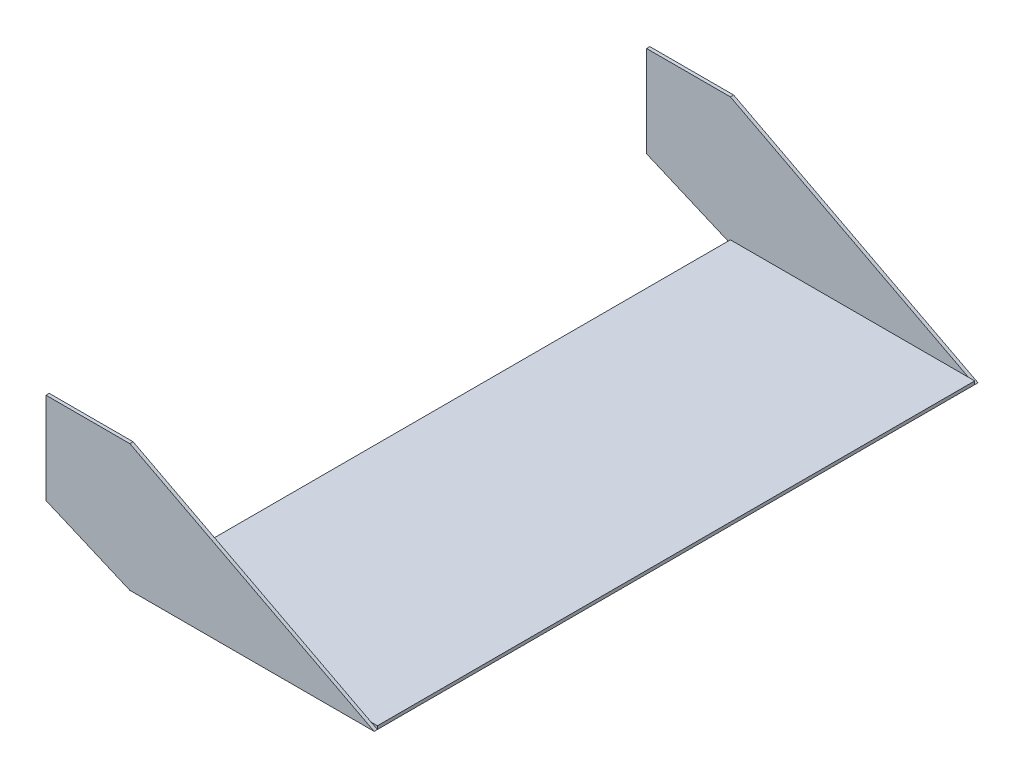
ISO-10303-21;
HEADER;
FILE_DESCRIPTION(('STEP AP214'),'2;1');
FILE_NAME('part.step','',(''),(''),'','','');
FILE_SCHEMA(('AUTOMOTIVE_DESIGN { 1 0 10303 214 1 1 1 1 }'));
ENDSEC;
DATA;
#1=APPLICATION_CONTEXT('core data for automotive mechanical design processes');
#2=APPLICATION_PROTOCOL_DEFINITION('international standard','automotive_design',2000,#1);
#3=PRODUCT_CONTEXT('',#1,'mechanical');
#4=PRODUCT('Part','Part','',(#3));
#5=PRODUCT_RELATED_PRODUCT_CATEGORY('part','',(#4));
#6=PRODUCT_DEFINITION_FORMATION('','',#4);
#7=PRODUCT_DEFINITION_CONTEXT('part definition',#1,'design');
#8=PRODUCT_DEFINITION('design','',#6,#7);
#9=PRODUCT_DEFINITION_SHAPE('','',#8);
#10=(LENGTH_UNIT() NAMED_UNIT(*) SI_UNIT(.MILLI.,.METRE.));
#11=(NAMED_UNIT(*) PLANE_ANGLE_UNIT() SI_UNIT($,.RADIAN.));
#12=(NAMED_UNIT(*) SI_UNIT($,.STERADIAN.) SOLID_ANGLE_UNIT());
#13=UNCERTAINTY_MEASURE_WITH_UNIT(LENGTH_MEASURE(1.E-05),#10,'distance_accuracy_value','');
#14=(GEOMETRIC_REPRESENTATION_CONTEXT(3) GLOBAL_UNCERTAINTY_ASSIGNED_CONTEXT((#13)) GLOBAL_UNIT_ASSIGNED_CONTEXT((#10,
#11,#12)) REPRESENTATION_CONTEXT('',''));
#15=CARTESIAN_POINT('',(0.,0.,0.));
#16=DIRECTION('',(0.,0.,1.));
#17=DIRECTION('',(1.,0.,0.));
#18=AXIS2_PLACEMENT_3D('',#15,#16,#17);
#19=CARTESIAN_POINT('',(347.829398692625,8.,0.));
#20=DIRECTION('',(0.,0.,1.));
#21=DIRECTION('',(1.,0.,0.));
#22=AXIS2_PLACEMENT_3D('',#19,#20,#21);
#23=PLANE('',#22);
#24=DIRECTION('',(1.,0.,1.03974831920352E-12));
#25=VECTOR('',#24,1.);
#26=CARTESIAN_POINT('',(649.999999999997,-21.999999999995,6.0008860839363E-12));
#27=LINE('',#26,#25);
#28=CARTESIAN_POINT('',(425.,-21.999999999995,-2.27942485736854E-10));
#29=VERTEX_POINT('',#28);
#30=CARTESIAN_POINT('',(644.230769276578,-21.999999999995,0.));
#31=VERTEX_POINT('',#30);
#32=EDGE_CURVE('E175',#29,#31,#27,.T.);
#33=ORIENTED_EDGE('',*,*,#32,.F.);
#34=DIRECTION('',(0.,-1.,-1.99940294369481E-12));
#35=VECTOR('',#34,1.);
#36=CARTESIAN_POINT('',(425.,-21.999999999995,-2.27942485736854E-10));
#37=LINE('',#36,#35);
#38=CARTESIAN_POINT('',(425.,-25.0000000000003,0.));
#39=VERTEX_POINT('',#38);
#40=EDGE_CURVE('E186',#29,#39,#37,.T.);
#41=ORIENTED_EDGE('',*,*,#40,.T.);
#42=DIRECTION('',(0.919460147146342,-0.393183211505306,0.));
#43=VECTOR('',#42,1.);
#44=CARTESIAN_POINT('',(347.829398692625,8.,0.));
#45=LINE('',#44,#43);
#46=CARTESIAN_POINT('',(347.829398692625,8.,0.));
#47=VERTEX_POINT('',#46);
#48=EDGE_CURVE('E197',#47,#39,#45,.T.);
#49=ORIENTED_EDGE('',*,*,#48,.F.);
#50=DIRECTION('',(0.,-1.,0.));
#51=VECTOR('',#50,1.);
#52=CARTESIAN_POINT('',(347.829398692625,8.,0.));
#53=LINE('',#52,#51);
#54=CARTESIAN_POINT('',(347.829398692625,92.,0.));
#55=VERTEX_POINT('',#54);
#56=EDGE_CURVE('E206',#55,#47,#53,.T.);
#57=ORIENTED_EDGE('',*,*,#56,.F.);
#58=DIRECTION('',(-1.,0.,0.));
#59=VECTOR('',#58,1.);
#60=CARTESIAN_POINT('',(347.829398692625,92.,0.));
#61=LINE('',#60,#59);
#62=CARTESIAN_POINT('',(425.,92.,0.));
#63=VERTEX_POINT('',#62);
#64=EDGE_CURVE('E204',#63,#55,#61,.T.);
#65=ORIENTED_EDGE('',*,*,#64,.F.);
#66=DIRECTION('',(-0.887216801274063,0.46135273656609,0.));
#67=VECTOR('',#66,1.);
#68=CARTESIAN_POINT('',(425.,92.,0.));
#69=LINE('',#68,#67);
#70=EDGE_CURVE('E200',#31,#63,#69,.T.);
#71=ORIENTED_EDGE('',*,*,#70,.F.);
#72=EDGE_LOOP('',(#33,#41,#49,#57,#65,#71));
#73=FACE_BOUND('',#72,.T.);
#74=ADVANCED_FACE('F24',(#73),#23,.F.);
#75=CARTESIAN_POINT('',(347.829398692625,8.,3.));
#76=DIRECTION('',(0.393183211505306,0.919460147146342,0.));
#77=DIRECTION('',(-0.919460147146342,0.393183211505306,0.));
#78=AXIS2_PLACEMENT_3D('',#75,#76,#77);
#79=PLANE('',#78);
#80=ORIENTED_EDGE('',*,*,#48,.T.);
#81=DIRECTION('',(0.,0.,-1.));
#82=VECTOR('',#81,1.);
#83=CARTESIAN_POINT('',(425.,-25.0000000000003,3.));
#84=LINE('',#83,#82);
#85=CARTESIAN_POINT('',(425.,-25.0000000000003,3.));
#86=VERTEX_POINT('',#85);
#87=EDGE_CURVE('E11',#86,#39,#84,.T.);
#88=ORIENTED_EDGE('',*,*,#87,.F.);
#89=DIRECTION('',(0.919460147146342,-0.393183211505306,0.));
#90=VECTOR('',#89,1.);
#91=CARTESIAN_POINT('',(347.829398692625,8.,3.));
#92=LINE('',#91,#90);
#93=CARTESIAN_POINT('',(347.829398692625,8.,3.));
#94=VERTEX_POINT('',#93);
#95=EDGE_CURVE('E208',#94,#86,#92,.T.);
#96=ORIENTED_EDGE('',*,*,#95,.F.);
#97=DIRECTION('',(0.,0.,-1.));
#98=VECTOR('',#97,1.);
#99=CARTESIAN_POINT('',(347.829398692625,8.,3.));
#100=LINE('',#99,#98);
#101=EDGE_CURVE('E217',#94,#47,#100,.T.);
#102=ORIENTED_EDGE('',*,*,#101,.T.);
#103=EDGE_LOOP('',(#80,#88,#96,#102));
#104=FACE_BOUND('',#103,.T.);
#105=ADVANCED_FACE('F26',(#104),#79,.F.);
#106=CARTESIAN_POINT('',(425.,-25.0000000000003,3.));
#107=DIRECTION('',(-1.08686593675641E-10,1.,0.));
#108=DIRECTION('',(-1.,-1.08686593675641E-10,0.));
#109=AXIS2_PLACEMENT_3D('',#106,#107,#108);
#110=PLANE('',#109);
#111=ORIENTED_EDGE('',*,*,#87,.T.);
#112=DIRECTION('',(0.,-1.99940442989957E-12,1.));
#113=VECTOR('',#112,1.);
#114=CARTESIAN_POINT('',(425.,-24.999999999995,-2.33940694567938E-10));
#115=LINE('',#114,#113);
#116=CARTESIAN_POINT('',(424.999999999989,-24.9999999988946,-550.));
#117=VERTEX_POINT('',#116);
#118=EDGE_CURVE('E136',#117,#39,#115,.T.);
#119=ORIENTED_EDGE('',*,*,#118,.F.);
#120=DIRECTION('',(0.,0.,-1.));
#121=VECTOR('',#120,1.);
#122=CARTESIAN_POINT('',(424.999999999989,-24.9999999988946,-550.));
#123=LINE('',#122,#121);
#124=CARTESIAN_POINT('',(424.999999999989,-24.9999999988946,-553.));
#125=VERTEX_POINT('',#124);
#126=EDGE_CURVE('E134',#117,#125,#123,.T.);
#127=ORIENTED_EDGE('',*,*,#126,.T.);
#128=DIRECTION('',(1.,1.08686593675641E-10,0.));
#129=VECTOR('',#128,1.);
#130=CARTESIAN_POINT('',(424.999999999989,-24.9999999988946,-553.));
#131=LINE('',#130,#129);
#132=CARTESIAN_POINT('',(649.999999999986,-24.9999999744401,-553.));
#133=VERTEX_POINT('',#132);
#134=EDGE_CURVE('E121',#125,#133,#131,.T.);
#135=ORIENTED_EDGE('',*,*,#134,.T.);
#136=DIRECTION('',(0.,0.,-1.));
#137=VECTOR('',#136,1.);
#138=CARTESIAN_POINT('',(649.999999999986,-24.9999999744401,-550.));
#139=LINE('',#138,#137);
#140=CARTESIAN_POINT('',(649.999999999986,-24.9999999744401,-550.));
#141=VERTEX_POINT('',#140);
#142=EDGE_CURVE('E141',#141,#133,#139,.T.);
#143=ORIENTED_EDGE('',*,*,#142,.F.);
#144=DIRECTION('',(0.,1.99940442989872E-12,-1.));
#145=VECTOR('',#144,1.);
#146=CARTESIAN_POINT('',(649.999999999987,-24.9999999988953,-549.999999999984));
#147=LINE('',#146,#145);
#148=CARTESIAN_POINT('',(649.999999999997,-24.999999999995,0.));
#149=VERTEX_POINT('',#148);
#150=EDGE_CURVE('E140',#149,#141,#147,.T.);
#151=ORIENTED_EDGE('',*,*,#150,.F.);
#152=DIRECTION('',(0.,0.,-1.));
#153=VECTOR('',#152,1.);
#154=CARTESIAN_POINT('',(649.999999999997,-24.9999999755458,3.));
#155=LINE('',#154,#153);
#156=CARTESIAN_POINT('',(649.999999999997,-24.9999999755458,3.));
#157=VERTEX_POINT('',#156);
#158=EDGE_CURVE('E32',#157,#149,#155,.T.);
#159=ORIENTED_EDGE('',*,*,#158,.F.);
#160=DIRECTION('',(1.,1.08686593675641E-10,0.));
#161=VECTOR('',#160,1.);
#162=CARTESIAN_POINT('',(425.,-25.0000000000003,3.));
#163=LINE('',#162,#161);
#164=EDGE_CURVE('E210',#86,#157,#163,.T.);
#165=ORIENTED_EDGE('',*,*,#164,.F.);
#166=EDGE_LOOP('',(#111,#119,#127,#135,#143,#151,#159,#165));
#167=FACE_BOUND('',#166,.T.);
#168=ADVANCED_FACE('F135',(#167),#110,.F.);
#169=CARTESIAN_POINT('',(425.,92.,3.));
#170=DIRECTION('',(-0.461352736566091,-0.887216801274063,0.));
#171=DIRECTION('',(0.887216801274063,-0.461352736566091,0.));
#172=AXIS2_PLACEMENT_3D('',#169,#170,#171);
#173=PLANE('',#172);
#174=EDGE_CURVE('E201',#149,#31,#69,.T.);
#175=ORIENTED_EDGE('',*,*,#174,.T.);
#176=ORIENTED_EDGE('',*,*,#70,.T.);
#177=DIRECTION('',(0.,0.,-1.));
#178=VECTOR('',#177,1.);
#179=CARTESIAN_POINT('',(425.,92.,3.));
#180=LINE('',#179,#178);
#181=CARTESIAN_POINT('',(425.,92.,3.));
#182=VERTEX_POINT('',#181);
#183=EDGE_CURVE('E223',#182,#63,#180,.T.);
#184=ORIENTED_EDGE('',*,*,#183,.F.);
#185=DIRECTION('',(-0.887216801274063,0.46135273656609,0.));
#186=VECTOR('',#185,1.);
#187=CARTESIAN_POINT('',(425.,92.,3.));
#188=LINE('',#187,#186);
#189=EDGE_CURVE('E212',#157,#182,#188,.T.);
#190=ORIENTED_EDGE('',*,*,#189,.F.);
#191=ORIENTED_EDGE('',*,*,#158,.T.);
#192=EDGE_LOOP('',(#175,#176,#184,#190,#191));
#193=FACE_BOUND('',#192,.T.);
#194=ADVANCED_FACE('F229',(#193),#173,.F.);
#195=CARTESIAN_POINT('',(347.829398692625,92.,3.));
#196=DIRECTION('',(0.,-1.,0.));
#197=DIRECTION('',(1.,0.,0.));
#198=AXIS2_PLACEMENT_3D('',#195,#196,#197);
#199=PLANE('',#198);
#200=ORIENTED_EDGE('',*,*,#64,.T.);
#201=DIRECTION('',(0.,0.,-1.));
#202=VECTOR('',#201,1.);
#203=CARTESIAN_POINT('',(347.829398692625,92.,3.));
#204=LINE('',#203,#202);
#205=CARTESIAN_POINT('',(347.829398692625,92.,3.));
#206=VERTEX_POINT('',#205);
#207=EDGE_CURVE('E220',#206,#55,#204,.T.);
#208=ORIENTED_EDGE('',*,*,#207,.F.);
#209=DIRECTION('',(-1.,0.,0.));
#210=VECTOR('',#209,1.);
#211=CARTESIAN_POINT('',(347.829398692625,92.,3.));
#212=LINE('',#211,#210);
#213=EDGE_CURVE('E214',#182,#206,#212,.T.);
#214=ORIENTED_EDGE('',*,*,#213,.F.);
#215=ORIENTED_EDGE('',*,*,#183,.T.);
#216=EDGE_LOOP('',(#200,#208,#214,#215));
#217=FACE_BOUND('',#216,.T.);
#218=ADVANCED_FACE('F251',(#217),#199,.F.);
#219=CARTESIAN_POINT('',(347.829398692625,8.,3.));
#220=DIRECTION('',(1.,0.,0.));
#221=DIRECTION('',(0.,0.,-1.));
#222=AXIS2_PLACEMENT_3D('',#219,#220,#221);
#223=PLANE('',#222);
#224=ORIENTED_EDGE('',*,*,#56,.T.);
#225=ORIENTED_EDGE('',*,*,#101,.F.);
#226=DIRECTION('',(0.,-1.,0.));
#227=VECTOR('',#226,1.);
#228=CARTESIAN_POINT('',(347.829398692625,8.,3.));
#229=LINE('',#228,#227);
#230=EDGE_CURVE('E47',#206,#94,#229,.T.);
#231=ORIENTED_EDGE('',*,*,#230,.F.);
#232=ORIENTED_EDGE('',*,*,#207,.T.);
#233=EDGE_LOOP('',(#224,#225,#231,#232));
#234=FACE_BOUND('',#233,.T.);
#235=ADVANCED_FACE('F292',(#234),#223,.F.);
#236=CARTESIAN_POINT('',(347.829398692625,8.,3.));
#237=DIRECTION('',(0.,0.,1.));
#238=DIRECTION('',(1.,0.,0.));
#239=AXIS2_PLACEMENT_3D('',#236,#237,#238);
#240=PLANE('',#239);
#241=ORIENTED_EDGE('',*,*,#95,.T.);
#242=ORIENTED_EDGE('',*,*,#164,.T.);
#243=ORIENTED_EDGE('',*,*,#189,.T.);
#244=ORIENTED_EDGE('',*,*,#213,.T.);
#245=ORIENTED_EDGE('',*,*,#230,.T.);
#246=EDGE_LOOP('',(#241,#242,#243,#244,#245));
#247=FACE_BOUND('',#246,.T.);
#248=ADVANCED_FACE('F253',(#247),#240,.T.);
#249=CARTESIAN_POINT('',(649.999999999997,-21.999999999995,6.0008860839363E-12));
#250=DIRECTION('',(1.03974831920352E-12,1.99940294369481E-12,-1.));
#251=DIRECTION('',(0.,1.,1.99940294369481E-12));
#252=AXIS2_PLACEMENT_3D('',#249,#250,#251);
#253=PLANE('',#252);
#254=ORIENTED_EDGE('',*,*,#174,.F.);
#255=DIRECTION('',(0.,-1.,-1.99940294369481E-12));
#256=VECTOR('',#255,1.);
#257=CARTESIAN_POINT('',(649.999999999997,-21.999999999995,6.0008860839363E-12));
#258=LINE('',#257,#256);
#259=CARTESIAN_POINT('',(649.999999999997,-21.999999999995,6.0008860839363E-12));
#260=VERTEX_POINT('',#259);
#261=EDGE_CURVE('E194',#260,#149,#258,.T.);
#262=ORIENTED_EDGE('',*,*,#261,.F.);
#263=EDGE_CURVE('E174',#31,#260,#27,.T.);
#264=ORIENTED_EDGE('',*,*,#263,.F.);
#265=EDGE_LOOP('',(#254,#262,#264));
#266=FACE_BOUND('',#265,.T.);
#267=ADVANCED_FACE('F238',(#266),#253,.F.);
#268=CARTESIAN_POINT('',(649.999999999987,-21.9999999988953,-549.999999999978));
#269=DIRECTION('',(-1.,0.,0.));
#270=DIRECTION('',(0.,0.,1.));
#271=AXIS2_PLACEMENT_3D('',#268,#269,#270);
#272=PLANE('',#271);
#273=ORIENTED_EDGE('',*,*,#150,.T.);
#274=DIRECTION('',(0.,-1.,-1.99940294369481E-12));
#275=VECTOR('',#274,1.);
#276=CARTESIAN_POINT('',(649.999999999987,-21.9999999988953,-549.999999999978));
#277=LINE('',#276,#275);
#278=CARTESIAN_POINT('',(649.999999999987,-21.9999999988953,-549.999999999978));
#279=VERTEX_POINT('',#278);
#280=EDGE_CURVE('E191',#279,#141,#277,.T.);
#281=ORIENTED_EDGE('',*,*,#280,.F.);
#282=DIRECTION('',(0.,1.99940442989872E-12,-1.));
#283=VECTOR('',#282,1.);
#284=CARTESIAN_POINT('',(649.999999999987,-21.9999999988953,-549.999999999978));
#285=LINE('',#284,#283);
#286=EDGE_CURVE('E178',#260,#279,#285,.T.);
#287=ORIENTED_EDGE('',*,*,#286,.F.);
#288=ORIENTED_EDGE('',*,*,#261,.T.);
#289=EDGE_LOOP('',(#273,#281,#287,#288));
#290=FACE_BOUND('',#289,.T.);
#291=ADVANCED_FACE('F236',(#290),#272,.F.);
#292=CARTESIAN_POINT('',(424.999999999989,-21.9999999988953,-549.999999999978));
#293=DIRECTION('',(0.,-1.99940294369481E-12,1.));
#294=DIRECTION('',(0.,-1.,-1.99940294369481E-12));
#295=AXIS2_PLACEMENT_3D('',#292,#293,#294);
#296=PLANE('',#295);
#297=ORIENTED_EDGE('',*,*,#280,.T.);
#298=DIRECTION('',(-0.887216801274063,0.46135273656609,0.));
#299=VECTOR('',#298,1.);
#300=CARTESIAN_POINT('',(424.999999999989,92.0000000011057,-550.));
#301=LINE('',#300,#299);
#302=CARTESIAN_POINT('',(644.230769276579,-21.9999999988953,-549.999999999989));
#303=VERTEX_POINT('',#302);
#304=EDGE_CURVE('E156',#141,#303,#301,.T.);
#305=ORIENTED_EDGE('',*,*,#304,.T.);
#306=DIRECTION('',(-1.,0.,0.));
#307=VECTOR('',#306,1.);
#308=CARTESIAN_POINT('',(424.999999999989,-21.9999999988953,-549.999999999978));
#309=LINE('',#308,#307);
#310=EDGE_CURVE('E181',#279,#303,#309,.T.);
#311=ORIENTED_EDGE('',*,*,#310,.F.);
#312=EDGE_LOOP('',(#297,#305,#311));
#313=FACE_BOUND('',#312,.T.);
#314=ADVANCED_FACE('F264',(#313),#296,.F.);
#315=CARTESIAN_POINT('',(425.,-21.999999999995,-2.27942485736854E-10));
#316=DIRECTION('',(1.,0.,0.));
#317=DIRECTION('',(0.,0.,-1.));
#318=AXIS2_PLACEMENT_3D('',#315,#316,#317);
#319=PLANE('',#318);
#320=ORIENTED_EDGE('',*,*,#118,.T.);
#321=ORIENTED_EDGE('',*,*,#40,.F.);
#322=DIRECTION('',(0.,-1.99940442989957E-12,1.));
#323=VECTOR('',#322,1.);
#324=CARTESIAN_POINT('',(425.,-21.999999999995,-2.27942485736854E-10));
#325=LINE('',#324,#323);
#326=CARTESIAN_POINT('',(424.999999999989,-21.9999999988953,-549.999999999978));
#327=VERTEX_POINT('',#326);
#328=EDGE_CURVE('E184',#327,#29,#325,.T.);
#329=ORIENTED_EDGE('',*,*,#328,.F.);
#330=DIRECTION('',(0.,-1.,-1.99940294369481E-12));
#331=VECTOR('',#330,1.);
#332=CARTESIAN_POINT('',(424.999999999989,-21.9999999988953,-549.999999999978));
#333=LINE('',#332,#331);
#334=EDGE_CURVE('E189',#327,#117,#333,.T.);
#335=ORIENTED_EDGE('',*,*,#334,.T.);
#336=EDGE_LOOP('',(#320,#321,#329,#335));
#337=FACE_BOUND('',#336,.T.);
#338=ADVANCED_FACE('F259',(#337),#319,.F.);
#339=CARTESIAN_POINT('',(649.999999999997,-21.999999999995,5.99820883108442E-12));
#340=DIRECTION('',(0.,1.,1.99940442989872E-12));
#341=DIRECTION('',(0.,-1.99940442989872E-12,1.));
#342=AXIS2_PLACEMENT_3D('',#339,#340,#341);
#343=PLANE('',#342);
#344=ORIENTED_EDGE('',*,*,#32,.T.);
#345=ORIENTED_EDGE('',*,*,#263,.T.);
#346=ORIENTED_EDGE('',*,*,#286,.T.);
#347=ORIENTED_EDGE('',*,*,#310,.T.);
#348=EDGE_CURVE('E180',#303,#327,#309,.T.);
#349=ORIENTED_EDGE('',*,*,#348,.T.);
#350=ORIENTED_EDGE('',*,*,#328,.T.);
#351=EDGE_LOOP('',(#344,#345,#346,#347,#349,#350));
#352=FACE_BOUND('',#351,.T.);
#353=ADVANCED_FACE('F242',(#352),#343,.T.);
#354=CARTESIAN_POINT('',(347.829398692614,8.00000000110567,-550.));
#355=DIRECTION('',(0.,0.,1.));
#356=DIRECTION('',(1.,0.,0.));
#357=AXIS2_PLACEMENT_3D('',#354,#355,#356);
#358=PLANE('',#357);
#359=ORIENTED_EDGE('',*,*,#334,.F.);
#360=ORIENTED_EDGE('',*,*,#348,.F.);
#361=CARTESIAN_POINT('',(424.999999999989,92.0000000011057,-550.));
#362=VERTEX_POINT('',#361);
#363=EDGE_CURVE('E39',#303,#362,#301,.T.);
#364=ORIENTED_EDGE('',*,*,#363,.T.);
#365=DIRECTION('',(-1.,0.,0.));
#366=VECTOR('',#365,1.);
#367=CARTESIAN_POINT('',(347.829398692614,92.0000000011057,-550.));
#368=LINE('',#367,#366);
#369=CARTESIAN_POINT('',(347.829398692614,92.0000000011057,-550.));
#370=VERTEX_POINT('',#369);
#371=EDGE_CURVE('E159',#362,#370,#368,.T.);
#372=ORIENTED_EDGE('',*,*,#371,.T.);
#373=DIRECTION('',(0.,-1.,0.));
#374=VECTOR('',#373,1.);
#375=CARTESIAN_POINT('',(347.829398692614,8.00000000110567,-550.));
#376=LINE('',#375,#374);
#377=CARTESIAN_POINT('',(347.829398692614,8.00000000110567,-550.));
#378=VERTEX_POINT('',#377);
#379=EDGE_CURVE('E161',#370,#378,#376,.T.);
#380=ORIENTED_EDGE('',*,*,#379,.T.);
#381=DIRECTION('',(0.919460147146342,-0.393183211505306,0.));
#382=VECTOR('',#381,1.);
#383=CARTESIAN_POINT('',(347.829398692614,8.00000000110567,-550.));
#384=LINE('',#383,#382);
#385=EDGE_CURVE('E154',#378,#117,#384,.T.);
#386=ORIENTED_EDGE('',*,*,#385,.T.);
#387=EDGE_LOOP('',(#359,#360,#364,#372,#380,#386));
#388=FACE_BOUND('',#387,.T.);
#389=ADVANCED_FACE('F261',(#388),#358,.T.);
#390=CARTESIAN_POINT('',(347.829398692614,8.00000000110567,-550.));
#391=DIRECTION('',(0.393183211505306,0.919460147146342,0.));
#392=DIRECTION('',(-0.919460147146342,0.393183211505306,0.));
#393=AXIS2_PLACEMENT_3D('',#390,#391,#392);
#394=PLANE('',#393);
#395=DIRECTION('',(0.919460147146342,-0.393183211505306,0.));
#396=VECTOR('',#395,1.);
#397=CARTESIAN_POINT('',(347.829398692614,8.00000000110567,-553.));
#398=LINE('',#397,#396);
#399=CARTESIAN_POINT('',(347.829398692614,8.00000000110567,-553.));
#400=VERTEX_POINT('',#399);
#401=EDGE_CURVE('E126',#400,#125,#398,.T.);
#402=ORIENTED_EDGE('',*,*,#401,.T.);
#403=ORIENTED_EDGE('',*,*,#126,.F.);
#404=ORIENTED_EDGE('',*,*,#385,.F.);
#405=DIRECTION('',(0.,0.,-1.));
#406=VECTOR('',#405,1.);
#407=CARTESIAN_POINT('',(347.829398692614,8.00000000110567,-550.));
#408=LINE('',#407,#406);
#409=EDGE_CURVE('E146',#378,#400,#408,.T.);
#410=ORIENTED_EDGE('',*,*,#409,.T.);
#411=EDGE_LOOP('',(#402,#403,#404,#410));
#412=FACE_BOUND('',#411,.T.);
#413=ADVANCED_FACE('F144',(#412),#394,.F.);
#414=CARTESIAN_POINT('',(424.999999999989,92.0000000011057,-550.));
#415=DIRECTION('',(-0.461352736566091,-0.887216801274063,0.));
#416=DIRECTION('',(0.887216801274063,-0.461352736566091,0.));
#417=AXIS2_PLACEMENT_3D('',#414,#415,#416);
#418=PLANE('',#417);
#419=DIRECTION('',(-0.887216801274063,0.46135273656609,0.));
#420=VECTOR('',#419,1.);
#421=CARTESIAN_POINT('',(424.999999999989,92.0000000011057,-553.));
#422=LINE('',#421,#420);
#423=CARTESIAN_POINT('',(424.999999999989,92.0000000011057,-553.));
#424=VERTEX_POINT('',#423);
#425=EDGE_CURVE('E128',#133,#424,#422,.T.);
#426=ORIENTED_EDGE('',*,*,#425,.T.);
#427=DIRECTION('',(0.,0.,-1.));
#428=VECTOR('',#427,1.);
#429=CARTESIAN_POINT('',(424.999999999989,92.0000000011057,-550.));
#430=LINE('',#429,#428);
#431=EDGE_CURVE('E167',#362,#424,#430,.T.);
#432=ORIENTED_EDGE('',*,*,#431,.F.);
#433=ORIENTED_EDGE('',*,*,#363,.F.);
#434=ORIENTED_EDGE('',*,*,#304,.F.);
#435=ORIENTED_EDGE('',*,*,#142,.T.);
#436=EDGE_LOOP('',(#426,#432,#433,#434,#435));
#437=FACE_BOUND('',#436,.T.);
#438=ADVANCED_FACE('F265',(#437),#418,.F.);
#439=CARTESIAN_POINT('',(347.829398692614,92.0000000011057,-550.));
#440=DIRECTION('',(0.,-1.,0.));
#441=DIRECTION('',(1.,0.,0.));
#442=AXIS2_PLACEMENT_3D('',#439,#440,#441);
#443=PLANE('',#442);
#444=DIRECTION('',(-1.,0.,0.));
#445=VECTOR('',#444,1.);
#446=CARTESIAN_POINT('',(347.829398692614,92.0000000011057,-553.));
#447=LINE('',#446,#445);
#448=CARTESIAN_POINT('',(347.829398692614,92.0000000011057,-553.));
#449=VERTEX_POINT('',#448);
#450=EDGE_CURVE('E150',#424,#449,#447,.T.);
#451=ORIENTED_EDGE('',*,*,#450,.T.);
#452=DIRECTION('',(0.,0.,-1.));
#453=VECTOR('',#452,1.);
#454=CARTESIAN_POINT('',(347.829398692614,92.0000000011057,-550.));
#455=LINE('',#454,#453);
#456=EDGE_CURVE('E164',#370,#449,#455,.T.);
#457=ORIENTED_EDGE('',*,*,#456,.F.);
#458=ORIENTED_EDGE('',*,*,#371,.F.);
#459=ORIENTED_EDGE('',*,*,#431,.T.);
#460=EDGE_LOOP('',(#451,#457,#458,#459));
#461=FACE_BOUND('',#460,.T.);
#462=ADVANCED_FACE('F268',(#461),#443,.F.);
#463=CARTESIAN_POINT('',(347.829398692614,8.00000000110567,-550.));
#464=DIRECTION('',(1.,0.,0.));
#465=DIRECTION('',(0.,0.,-1.));
#466=AXIS2_PLACEMENT_3D('',#463,#464,#465);
#467=PLANE('',#466);
#468=DIRECTION('',(0.,-1.,0.));
#469=VECTOR('',#468,1.);
#470=CARTESIAN_POINT('',(347.829398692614,8.00000000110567,-553.));
#471=LINE('',#470,#469);
#472=EDGE_CURVE('E152',#449,#400,#471,.T.);
#473=ORIENTED_EDGE('',*,*,#472,.T.);
#474=ORIENTED_EDGE('',*,*,#409,.F.);
#475=ORIENTED_EDGE('',*,*,#379,.F.);
#476=ORIENTED_EDGE('',*,*,#456,.T.);
#477=EDGE_LOOP('',(#473,#474,#475,#476));
#478=FACE_BOUND('',#477,.T.);
#479=ADVANCED_FACE('F271',(#478),#467,.F.);
#480=CARTESIAN_POINT('',(347.829398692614,8.00000000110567,-553.));
#481=DIRECTION('',(0.,0.,1.));
#482=DIRECTION('',(1.,0.,0.));
#483=AXIS2_PLACEMENT_3D('',#480,#481,#482);
#484=PLANE('',#483);
#485=ORIENTED_EDGE('',*,*,#401,.F.);
#486=ORIENTED_EDGE('',*,*,#472,.F.);
#487=ORIENTED_EDGE('',*,*,#450,.F.);
#488=ORIENTED_EDGE('',*,*,#425,.F.);
#489=ORIENTED_EDGE('',*,*,#134,.F.);
#490=EDGE_LOOP('',(#485,#486,#487,#488,#489));
#491=FACE_BOUND('',#490,.T.);
#492=ADVANCED_FACE('F123',(#491),#484,.F.);
#493=CLOSED_SHELL('',(#74,#105,#168,#194,#218,#235,#248,#267,#291,#314,#338,#353,#389,#413,#438,
#462,#479,#492));
#494=MANIFOLD_SOLID_BREP('B2',#493);
#495=ADVANCED_BREP_SHAPE_REPRESENTATION('',(#18,#494),#14);
#496=SHAPE_DEFINITION_REPRESENTATION(#9,#495);
ENDSEC;
END-ISO-10303-21;
